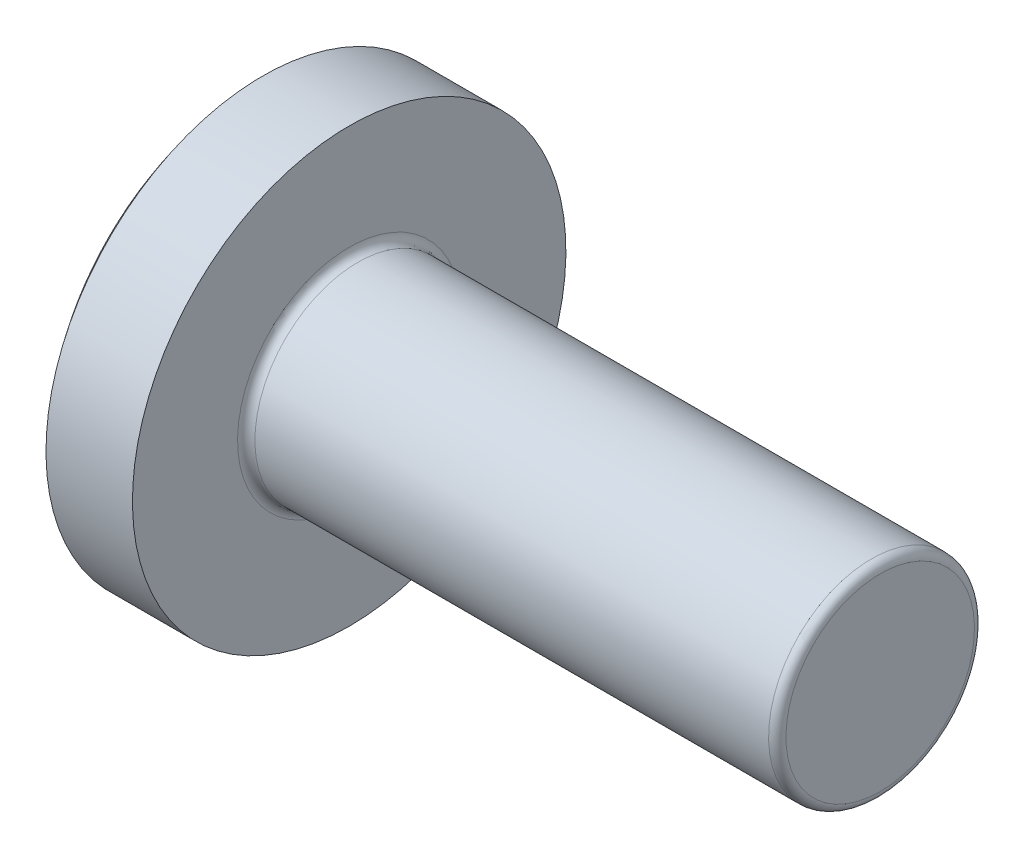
ISO-10303-21;
HEADER;
FILE_DESCRIPTION(('STEP AP214'),'2;1');
FILE_NAME('part.step','',(''),(''),'','','');
FILE_SCHEMA(('AUTOMOTIVE_DESIGN { 1 0 10303 214 1 1 1 1 }'));
ENDSEC;
DATA;
#1=APPLICATION_CONTEXT('core data for automotive mechanical design processes');
#2=APPLICATION_PROTOCOL_DEFINITION('international standard','automotive_design',2000,#1);
#3=PRODUCT_CONTEXT('',#1,'mechanical');
#4=PRODUCT('Part','Part','',(#3));
#5=PRODUCT_RELATED_PRODUCT_CATEGORY('part','',(#4));
#6=PRODUCT_DEFINITION_FORMATION('','',#4);
#7=PRODUCT_DEFINITION_CONTEXT('part definition',#1,'design');
#8=PRODUCT_DEFINITION('design','',#6,#7);
#9=PRODUCT_DEFINITION_SHAPE('','',#8);
#10=(LENGTH_UNIT() NAMED_UNIT(*) SI_UNIT(.MILLI.,.METRE.));
#11=(NAMED_UNIT(*) PLANE_ANGLE_UNIT() SI_UNIT($,.RADIAN.));
#12=(NAMED_UNIT(*) SI_UNIT($,.STERADIAN.) SOLID_ANGLE_UNIT());
#13=UNCERTAINTY_MEASURE_WITH_UNIT(LENGTH_MEASURE(1.E-05),#10,'distance_accuracy_value','');
#14=(GEOMETRIC_REPRESENTATION_CONTEXT(3) GLOBAL_UNCERTAINTY_ASSIGNED_CONTEXT((#13)) GLOBAL_UNIT_ASSIGNED_CONTEXT((#10,
#11,#12)) REPRESENTATION_CONTEXT('',''));
#15=CARTESIAN_POINT('',(0.,0.,0.));
#16=DIRECTION('',(0.,0.,1.));
#17=DIRECTION('',(1.,0.,0.));
#18=AXIS2_PLACEMENT_3D('',#15,#16,#17);
#19=CARTESIAN_POINT('',(16.,0.,0.));
#20=DIRECTION('',(-1.,0.,0.));
#21=DIRECTION('',(0.,1.,0.));
#22=AXIS2_PLACEMENT_3D('',#19,#20,#21);
#23=SPHERICAL_SURFACE('',#22,16.);
#24=CARTESIAN_POINT('',(3.5100040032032,0.,0.));
#25=DIRECTION('',(-1.,0.,0.));
#26=DIRECTION('',(0.,-1.,0.));
#27=AXIS2_PLACEMENT_3D('',#24,#25,#26);
#28=CIRCLE('',#27,10.);
#29=CARTESIAN_POINT('',(3.5100040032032,-10.,0.));
#30=VERTEX_POINT('',#29);
#31=EDGE_CURVE('E190',#30,#30,#28,.T.);
#32=ORIENTED_EDGE('',*,*,#31,.T.);
#33=EDGE_LOOP('',(#32));
#34=FACE_BOUND('',#33,.T.);
#35=CARTESIAN_POINT('',(16.,0.,-1.01));
#36=DIRECTION('',(0.,0.,1.));
#37=DIRECTION('',(0.,-1.,0.));
#38=AXIS2_PLACEMENT_3D('',#35,#36,#37);
#39=CIRCLE('',#38,15.9680900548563);
#40=CARTESIAN_POINT('',(0.71931245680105,4.63470475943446,-1.01));
#41=VERTEX_POINT('',#40);
#42=CARTESIAN_POINT('',(0.0638837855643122,1.01,-1.01));
#43=VERTEX_POINT('',#42);
#44=EDGE_CURVE('E176',#41,#43,#39,.T.);
#45=ORIENTED_EDGE('',*,*,#44,.F.);
#46=CARTESIAN_POINT('',(14.1867141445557,-3.14070323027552,0.));
#47=DIRECTION('',(-0.500000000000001,-0.866025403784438,0.));
#48=DIRECTION('',(0.866025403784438,-0.500000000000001,0.));
#49=AXIS2_PLACEMENT_3D('',#46,#47,#48);
#50=CIRCLE('',#49,15.5835803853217);
#51=CARTESIAN_POINT('',(0.71931245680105,4.63470475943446,1.01));
#52=VERTEX_POINT('',#51);
#53=EDGE_CURVE('E172',#52,#41,#50,.T.);
#54=ORIENTED_EDGE('',*,*,#53,.F.);
#55=CARTESIAN_POINT('',(16.,0.,1.01));
#56=DIRECTION('',(0.,0.,-1.));
#57=DIRECTION('',(0.,1.,0.));
#58=AXIS2_PLACEMENT_3D('',#55,#56,#57);
#59=CIRCLE('',#58,15.9680900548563);
#60=CARTESIAN_POINT('',(0.0638837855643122,1.01,1.01));
#61=VERTEX_POINT('',#60);
#62=EDGE_CURVE('E173',#61,#52,#59,.T.);
#63=ORIENTED_EDGE('',*,*,#62,.F.);
#64=CARTESIAN_POINT('',(16.,1.01,0.));
#65=DIRECTION('',(0.,-1.,0.));
#66=DIRECTION('',(0.,0.,-1.));
#67=AXIS2_PLACEMENT_3D('',#64,#65,#66);
#68=CIRCLE('',#67,15.9680900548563);
#69=CARTESIAN_POINT('',(0.71931245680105,1.01,4.63470475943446));
#70=VERTEX_POINT('',#69);
#71=EDGE_CURVE('E170',#70,#61,#68,.T.);
#72=ORIENTED_EDGE('',*,*,#71,.F.);
#73=CARTESIAN_POINT('',(14.1867141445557,0.,-3.14070323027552));
#74=DIRECTION('',(-0.500000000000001,0.,-0.866025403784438));
#75=DIRECTION('',(-0.866025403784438,0.,0.500000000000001));
#76=AXIS2_PLACEMENT_3D('',#73,#74,#75);
#77=CIRCLE('',#76,15.5835803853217);
#78=CARTESIAN_POINT('',(0.71931245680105,-1.01,4.63470475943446));
#79=VERTEX_POINT('',#78);
#80=EDGE_CURVE('E164',#79,#70,#77,.T.);
#81=ORIENTED_EDGE('',*,*,#80,.F.);
#82=CARTESIAN_POINT('',(16.,-1.01,0.));
#83=DIRECTION('',(0.,1.,0.));
#84=DIRECTION('',(0.,0.,1.));
#85=AXIS2_PLACEMENT_3D('',#82,#83,#84);
#86=CIRCLE('',#85,15.9680900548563);
#87=CARTESIAN_POINT('',(0.0638837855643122,-1.01,1.01));
#88=VERTEX_POINT('',#87);
#89=EDGE_CURVE('E150',#88,#79,#86,.T.);
#90=ORIENTED_EDGE('',*,*,#89,.F.);
#91=CARTESIAN_POINT('',(16.,0.,1.01));
#92=DIRECTION('',(0.,0.,-1.));
#93=DIRECTION('',(0.,1.,0.));
#94=AXIS2_PLACEMENT_3D('',#91,#92,#93);
#95=CIRCLE('',#94,15.9680900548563);
#96=CARTESIAN_POINT('',(0.71931245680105,-4.63470475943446,1.01));
#97=VERTEX_POINT('',#96);
#98=EDGE_CURVE('E139',#97,#88,#95,.T.);
#99=ORIENTED_EDGE('',*,*,#98,.F.);
#100=CARTESIAN_POINT('',(14.1867141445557,3.14070323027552,0.));
#101=DIRECTION('',(-0.500000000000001,0.866025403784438,0.));
#102=DIRECTION('',(-0.866025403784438,-0.500000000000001,0.));
#103=AXIS2_PLACEMENT_3D('',#100,#101,#102);
#104=CIRCLE('',#103,15.5835803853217);
#105=CARTESIAN_POINT('',(0.71931245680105,-4.63470475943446,-1.01));
#106=VERTEX_POINT('',#105);
#107=EDGE_CURVE('E152',#106,#97,#104,.T.);
#108=ORIENTED_EDGE('',*,*,#107,.F.);
#109=CARTESIAN_POINT('',(16.,0.,-1.01));
#110=DIRECTION('',(0.,0.,1.));
#111=DIRECTION('',(0.,-1.,0.));
#112=AXIS2_PLACEMENT_3D('',#109,#110,#111);
#113=CIRCLE('',#112,15.9680900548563);
#114=CARTESIAN_POINT('',(0.0638837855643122,-1.01,-1.01));
#115=VERTEX_POINT('',#114);
#116=EDGE_CURVE('E202',#115,#106,#113,.T.);
#117=ORIENTED_EDGE('',*,*,#116,.F.);
#118=CARTESIAN_POINT('',(16.,-1.01,0.));
#119=DIRECTION('',(0.,1.,0.));
#120=DIRECTION('',(0.,0.,1.));
#121=AXIS2_PLACEMENT_3D('',#118,#119,#120);
#122=CIRCLE('',#121,15.9680900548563);
#123=CARTESIAN_POINT('',(0.71931245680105,-1.01,-4.63470475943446));
#124=VERTEX_POINT('',#123);
#125=EDGE_CURVE('E188',#124,#115,#122,.T.);
#126=ORIENTED_EDGE('',*,*,#125,.F.);
#127=CARTESIAN_POINT('',(14.1867141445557,0.,3.14070323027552));
#128=DIRECTION('',(-0.500000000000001,0.,0.866025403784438));
#129=DIRECTION('',(0.866025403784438,0.,0.500000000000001));
#130=AXIS2_PLACEMENT_3D('',#127,#128,#129);
#131=CIRCLE('',#130,15.5835803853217);
#132=CARTESIAN_POINT('',(0.71931245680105,1.01,-4.63470475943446));
#133=VERTEX_POINT('',#132);
#134=EDGE_CURVE('E189',#133,#124,#131,.T.);
#135=ORIENTED_EDGE('',*,*,#134,.F.);
#136=CARTESIAN_POINT('',(16.,1.01,0.));
#137=DIRECTION('',(0.,-1.,0.));
#138=DIRECTION('',(0.,0.,-1.));
#139=AXIS2_PLACEMENT_3D('',#136,#137,#138);
#140=CIRCLE('',#139,15.9680900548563);
#141=EDGE_CURVE('E191',#43,#133,#140,.T.);
#142=ORIENTED_EDGE('',*,*,#141,.F.);
#143=EDGE_LOOP('',(#45,#54,#63,#72,#81,#90,#99,#108,#117,#126,#135,#142));
#144=FACE_BOUND('',#143,.T.);
#145=ADVANCED_FACE('F43',(#34,#144),#23,.T.);
#146=CARTESIAN_POINT('',(32.,0.,0.));
#147=DIRECTION('',(-1.,0.,0.));
#148=DIRECTION('',(0.,-1.,0.));
#149=AXIS2_PLACEMENT_3D('',#146,#147,#148);
#150=PLANE('',#149);
#151=CARTESIAN_POINT('',(32.,0.,0.));
#152=DIRECTION('',(-1.,0.,0.));
#153=DIRECTION('',(0.,-1.,0.));
#154=AXIS2_PLACEMENT_3D('',#151,#152,#153);
#155=CIRCLE('',#154,4.35000000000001);
#156=CARTESIAN_POINT('',(32.,-4.35000000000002,0.));
#157=VERTEX_POINT('',#156);
#158=EDGE_CURVE('E52',#157,#157,#155,.F.);
#159=ORIENTED_EDGE('',*,*,#158,.T.);
#160=EDGE_LOOP('',(#159));
#161=FACE_BOUND('',#160,.T.);
#162=ADVANCED_FACE('F293',(#161),#150,.F.);
#163=CARTESIAN_POINT('',(-8.63564927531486,0.,0.));
#164=DIRECTION('',(-1.,0.,0.));
#165=DIRECTION('',(0.,-1.,0.));
#166=AXIS2_PLACEMENT_3D('',#163,#164,#165);
#167=CYLINDRICAL_SURFACE('',#166,4.75000000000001);
#168=CARTESIAN_POINT('',(31.6,0.,0.));
#169=DIRECTION('',(-1.,0.,0.));
#170=DIRECTION('',(0.,-1.,0.));
#171=AXIS2_PLACEMENT_3D('',#168,#169,#170);
#172=CIRCLE('',#171,4.75000000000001);
#173=CARTESIAN_POINT('',(31.6,-4.75000000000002,0.));
#174=VERTEX_POINT('',#173);
#175=EDGE_CURVE('E238',#174,#174,#172,.T.);
#176=ORIENTED_EDGE('',*,*,#175,.T.);
#177=EDGE_LOOP('',(#176));
#178=FACE_BOUND('',#177,.T.);
#179=CARTESIAN_POINT('',(7.9,0.,0.));
#180=DIRECTION('',(-1.,0.,0.));
#181=DIRECTION('',(0.,-1.,0.));
#182=AXIS2_PLACEMENT_3D('',#179,#180,#181);
#183=CIRCLE('',#182,4.75000000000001);
#184=CARTESIAN_POINT('',(7.9,-4.75000000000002,0.));
#185=VERTEX_POINT('',#184);
#186=EDGE_CURVE('E232',#185,#185,#183,.F.);
#187=ORIENTED_EDGE('',*,*,#186,.T.);
#188=EDGE_LOOP('',(#187));
#189=FACE_BOUND('',#188,.T.);
#190=ADVANCED_FACE('F299',(#178,#189),#167,.T.);
#191=CARTESIAN_POINT('',(7.5,4.75,0.));
#192=DIRECTION('',(-1.,0.,0.));
#193=DIRECTION('',(0.,-1.,0.));
#194=AXIS2_PLACEMENT_3D('',#191,#192,#193);
#195=PLANE('',#194);
#196=CARTESIAN_POINT('',(7.5,0.,0.));
#197=DIRECTION('',(-1.,0.,0.));
#198=DIRECTION('',(0.,-1.,0.));
#199=AXIS2_PLACEMENT_3D('',#196,#197,#198);
#200=CIRCLE('',#199,5.15000000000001);
#201=CARTESIAN_POINT('',(7.5,-5.15000000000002,0.));
#202=VERTEX_POINT('',#201);
#203=EDGE_CURVE('E11',#202,#202,#200,.T.);
#204=ORIENTED_EDGE('',*,*,#203,.T.);
#205=EDGE_LOOP('',(#204));
#206=FACE_BOUND('',#205,.T.);
#207=CARTESIAN_POINT('',(7.5,0.,0.));
#208=DIRECTION('',(-1.,0.,0.));
#209=DIRECTION('',(0.,-1.,0.));
#210=AXIS2_PLACEMENT_3D('',#207,#208,#209);
#211=CIRCLE('',#210,10.);
#212=CARTESIAN_POINT('',(7.49999999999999,-10.,0.));
#213=VERTEX_POINT('',#212);
#214=EDGE_CURVE('E233',#213,#213,#211,.T.);
#215=ORIENTED_EDGE('',*,*,#214,.F.);
#216=EDGE_LOOP('',(#215));
#217=FACE_BOUND('',#216,.T.);
#218=ADVANCED_FACE('F308',(#206,#217),#195,.F.);
#219=CARTESIAN_POINT('',(-8.63564927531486,0.,0.));
#220=DIRECTION('',(-1.,0.,0.));
#221=DIRECTION('',(0.,-1.,0.));
#222=AXIS2_PLACEMENT_3D('',#219,#220,#221);
#223=CYLINDRICAL_SURFACE('',#222,10.);
#224=ORIENTED_EDGE('',*,*,#31,.F.);
#225=EDGE_LOOP('',(#224));
#226=FACE_BOUND('',#225,.T.);
#227=ORIENTED_EDGE('',*,*,#214,.T.);
#228=EDGE_LOOP('',(#227));
#229=FACE_BOUND('',#228,.T.);
#230=ADVANCED_FACE('F304',(#226,#229),#223,.T.);
#231=CARTESIAN_POINT('',(5.2,5.05,-1.01));
#232=DIRECTION('',(0.,0.,1.));
#233=DIRECTION('',(0.,-1.,0.));
#234=AXIS2_PLACEMENT_3D('',#231,#232,#233);
#235=PLANE('',#234);
#236=ORIENTED_EDGE('',*,*,#44,.T.);
#237=DIRECTION('',(-1.,0.,0.));
#238=VECTOR('',#237,1.);
#239=CARTESIAN_POINT('',(5.2,1.01,-1.01));
#240=LINE('',#239,#238);
#241=CARTESIAN_POINT('',(5.2,1.01,-1.01));
#242=VERTEX_POINT('',#241);
#243=EDGE_CURVE('E62',#242,#43,#240,.T.);
#244=ORIENTED_EDGE('',*,*,#243,.F.);
#245=DIRECTION('',(0.,1.,0.));
#246=VECTOR('',#245,1.);
#247=CARTESIAN_POINT('',(5.2,5.05,-1.01));
#248=LINE('',#247,#246);
#249=CARTESIAN_POINT('',(5.2,2.04777860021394,-1.01));
#250=VERTEX_POINT('',#249);
#251=EDGE_CURVE('E183',#242,#250,#248,.T.);
#252=ORIENTED_EDGE('',*,*,#251,.T.);
#253=DIRECTION('',(-0.866025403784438,0.500000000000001,0.));
#254=VECTOR('',#253,1.);
#255=CARTESIAN_POINT('',(0.,5.05,-1.01));
#256=LINE('',#255,#254);
#257=EDGE_CURVE('E179',#250,#41,#256,.T.);
#258=ORIENTED_EDGE('',*,*,#257,.T.);
#259=EDGE_LOOP('',(#236,#244,#252,#258));
#260=FACE_BOUND('',#259,.T.);
#261=ADVANCED_FACE('F271',(#260),#235,.T.);
#262=CARTESIAN_POINT('',(0.,5.05,0.));
#263=DIRECTION('',(-0.500000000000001,-0.866025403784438,0.));
#264=DIRECTION('',(0.866025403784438,-0.500000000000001,0.));
#265=AXIS2_PLACEMENT_3D('',#262,#263,#264);
#266=PLANE('',#265);
#267=ORIENTED_EDGE('',*,*,#53,.T.);
#268=ORIENTED_EDGE('',*,*,#257,.F.);
#269=DIRECTION('',(0.,0.,1.));
#270=VECTOR('',#269,1.);
#271=CARTESIAN_POINT('',(5.2,2.04777860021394,0.));
#272=LINE('',#271,#270);
#273=CARTESIAN_POINT('',(5.2,2.04777860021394,1.01));
#274=VERTEX_POINT('',#273);
#275=EDGE_CURVE('E185',#250,#274,#272,.T.);
#276=ORIENTED_EDGE('',*,*,#275,.T.);
#277=DIRECTION('',(-0.866025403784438,0.500000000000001,0.));
#278=VECTOR('',#277,1.);
#279=CARTESIAN_POINT('',(3.89999999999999,2.79833395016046,1.01));
#280=LINE('',#279,#278);
#281=EDGE_CURVE('E180',#274,#52,#280,.T.);
#282=ORIENTED_EDGE('',*,*,#281,.T.);
#283=EDGE_LOOP('',(#267,#268,#276,#282));
#284=FACE_BOUND('',#283,.T.);
#285=ADVANCED_FACE('F273',(#284),#266,.T.);
#286=CARTESIAN_POINT('',(5.2,5.05,1.01));
#287=DIRECTION('',(0.,0.,-1.));
#288=DIRECTION('',(0.,1.,0.));
#289=AXIS2_PLACEMENT_3D('',#286,#287,#288);
#290=PLANE('',#289);
#291=ORIENTED_EDGE('',*,*,#62,.T.);
#292=ORIENTED_EDGE('',*,*,#281,.F.);
#293=DIRECTION('',(0.,-1.,0.));
#294=VECTOR('',#293,1.);
#295=CARTESIAN_POINT('',(5.2,5.05,1.01));
#296=LINE('',#295,#294);
#297=CARTESIAN_POINT('',(5.2,1.01,1.01));
#298=VERTEX_POINT('',#297);
#299=EDGE_CURVE('E127',#274,#298,#296,.T.);
#300=ORIENTED_EDGE('',*,*,#299,.T.);
#301=DIRECTION('',(-1.,0.,0.));
#302=VECTOR('',#301,1.);
#303=CARTESIAN_POINT('',(5.2,1.01,1.01));
#304=LINE('',#303,#302);
#305=EDGE_CURVE('E181',#298,#61,#304,.T.);
#306=ORIENTED_EDGE('',*,*,#305,.T.);
#307=EDGE_LOOP('',(#291,#292,#300,#306));
#308=FACE_BOUND('',#307,.T.);
#309=ADVANCED_FACE('F279',(#308),#290,.T.);
#310=CARTESIAN_POINT('',(5.2,1.01,1.01));
#311=DIRECTION('',(0.,-1.,0.));
#312=DIRECTION('',(0.,0.,-1.));
#313=AXIS2_PLACEMENT_3D('',#310,#311,#312);
#314=PLANE('',#313);
#315=ORIENTED_EDGE('',*,*,#71,.T.);
#316=ORIENTED_EDGE('',*,*,#305,.F.);
#317=DIRECTION('',(0.,0.,1.));
#318=VECTOR('',#317,1.);
#319=CARTESIAN_POINT('',(5.2,1.01,1.01));
#320=LINE('',#319,#318);
#321=CARTESIAN_POINT('',(5.2,1.01,2.04777860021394));
#322=VERTEX_POINT('',#321);
#323=EDGE_CURVE('E118',#298,#322,#320,.T.);
#324=ORIENTED_EDGE('',*,*,#323,.T.);
#325=DIRECTION('',(-0.866025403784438,0.,0.500000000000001));
#326=VECTOR('',#325,1.);
#327=CARTESIAN_POINT('',(0.,1.01,5.05));
#328=LINE('',#327,#326);
#329=EDGE_CURVE('E50',#322,#70,#328,.T.);
#330=ORIENTED_EDGE('',*,*,#329,.T.);
#331=EDGE_LOOP('',(#315,#316,#324,#330));
#332=FACE_BOUND('',#331,.T.);
#333=ADVANCED_FACE('F278',(#332),#314,.T.);
#334=CARTESIAN_POINT('',(0.,0.,5.05));
#335=DIRECTION('',(-0.500000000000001,0.,-0.866025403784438));
#336=DIRECTION('',(-0.866025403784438,0.,0.500000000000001));
#337=AXIS2_PLACEMENT_3D('',#334,#335,#336);
#338=PLANE('',#337);
#339=ORIENTED_EDGE('',*,*,#80,.T.);
#340=ORIENTED_EDGE('',*,*,#329,.F.);
#341=DIRECTION('',(0.,-1.,0.));
#342=VECTOR('',#341,1.);
#343=CARTESIAN_POINT('',(5.2,0.,2.04777860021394));
#344=LINE('',#343,#342);
#345=CARTESIAN_POINT('',(5.2,-1.01,2.04777860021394));
#346=VERTEX_POINT('',#345);
#347=EDGE_CURVE('E214',#322,#346,#344,.T.);
#348=ORIENTED_EDGE('',*,*,#347,.T.);
#349=DIRECTION('',(-0.866025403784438,0.,0.500000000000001));
#350=VECTOR('',#349,1.);
#351=CARTESIAN_POINT('',(5.64937131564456,-1.01,1.78833395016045));
#352=LINE('',#351,#350);
#353=EDGE_CURVE('E157',#346,#79,#352,.T.);
#354=ORIENTED_EDGE('',*,*,#353,.T.);
#355=EDGE_LOOP('',(#339,#340,#348,#354));
#356=FACE_BOUND('',#355,.T.);
#357=ADVANCED_FACE('F280',(#356),#338,.T.);
#358=CARTESIAN_POINT('',(5.2,-1.01,1.01));
#359=DIRECTION('',(0.,1.,0.));
#360=DIRECTION('',(0.,0.,1.));
#361=AXIS2_PLACEMENT_3D('',#358,#359,#360);
#362=PLANE('',#361);
#363=ORIENTED_EDGE('',*,*,#89,.T.);
#364=ORIENTED_EDGE('',*,*,#353,.F.);
#365=DIRECTION('',(0.,0.,-1.));
#366=VECTOR('',#365,1.);
#367=CARTESIAN_POINT('',(5.2,-1.01,1.01));
#368=LINE('',#367,#366);
#369=CARTESIAN_POINT('',(5.2,-1.01,1.01));
#370=VERTEX_POINT('',#369);
#371=EDGE_CURVE('E156',#346,#370,#368,.T.);
#372=ORIENTED_EDGE('',*,*,#371,.T.);
#373=DIRECTION('',(-1.,0.,0.));
#374=VECTOR('',#373,1.);
#375=CARTESIAN_POINT('',(5.2,-1.01,1.01));
#376=LINE('',#375,#374);
#377=EDGE_CURVE('E141',#370,#88,#376,.T.);
#378=ORIENTED_EDGE('',*,*,#377,.T.);
#379=EDGE_LOOP('',(#363,#364,#372,#378));
#380=FACE_BOUND('',#379,.T.);
#381=ADVANCED_FACE('F151',(#380),#362,.T.);
#382=CARTESIAN_POINT('',(5.2,-5.05,1.01));
#383=DIRECTION('',(0.,0.,-1.));
#384=DIRECTION('',(0.,1.,0.));
#385=AXIS2_PLACEMENT_3D('',#382,#383,#384);
#386=PLANE('',#385);
#387=ORIENTED_EDGE('',*,*,#98,.T.);
#388=ORIENTED_EDGE('',*,*,#377,.F.);
#389=DIRECTION('',(0.,-1.,0.));
#390=VECTOR('',#389,1.);
#391=CARTESIAN_POINT('',(5.2,-5.05,1.01));
#392=LINE('',#391,#390);
#393=CARTESIAN_POINT('',(5.2,-2.04777860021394,1.01));
#394=VERTEX_POINT('',#393);
#395=EDGE_CURVE('E211',#370,#394,#392,.T.);
#396=ORIENTED_EDGE('',*,*,#395,.T.);
#397=DIRECTION('',(-0.866025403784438,-0.500000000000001,0.));
#398=VECTOR('',#397,1.);
#399=CARTESIAN_POINT('',(0.,-5.05,1.01));
#400=LINE('',#399,#398);
#401=EDGE_CURVE('E146',#394,#97,#400,.T.);
#402=ORIENTED_EDGE('',*,*,#401,.T.);
#403=EDGE_LOOP('',(#387,#388,#396,#402));
#404=FACE_BOUND('',#403,.T.);
#405=ADVANCED_FACE('F145',(#404),#386,.T.);
#406=CARTESIAN_POINT('',(0.,-5.05,0.));
#407=DIRECTION('',(-0.500000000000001,0.866025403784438,0.));
#408=DIRECTION('',(-0.866025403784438,-0.500000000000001,0.));
#409=AXIS2_PLACEMENT_3D('',#406,#407,#408);
#410=PLANE('',#409);
#411=ORIENTED_EDGE('',*,*,#107,.T.);
#412=ORIENTED_EDGE('',*,*,#401,.F.);
#413=DIRECTION('',(0.,0.,-1.));
#414=VECTOR('',#413,1.);
#415=CARTESIAN_POINT('',(5.2,-2.04777860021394,0.));
#416=LINE('',#415,#414);
#417=CARTESIAN_POINT('',(5.2,-2.04777860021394,-1.01));
#418=VERTEX_POINT('',#417);
#419=EDGE_CURVE('E206',#394,#418,#416,.T.);
#420=ORIENTED_EDGE('',*,*,#419,.T.);
#421=DIRECTION('',(-0.866025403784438,-0.500000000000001,0.));
#422=VECTOR('',#421,1.);
#423=CARTESIAN_POINT('',(3.89999999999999,-2.79833395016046,-1.01));
#424=LINE('',#423,#422);
#425=EDGE_CURVE('E204',#418,#106,#424,.T.);
#426=ORIENTED_EDGE('',*,*,#425,.T.);
#427=EDGE_LOOP('',(#411,#412,#420,#426));
#428=FACE_BOUND('',#427,.T.);
#429=ADVANCED_FACE('F251',(#428),#410,.T.);
#430=CARTESIAN_POINT('',(5.2,-5.05,-1.01));
#431=DIRECTION('',(0.,0.,1.));
#432=DIRECTION('',(0.,-1.,0.));
#433=AXIS2_PLACEMENT_3D('',#430,#431,#432);
#434=PLANE('',#433);
#435=ORIENTED_EDGE('',*,*,#116,.T.);
#436=ORIENTED_EDGE('',*,*,#425,.F.);
#437=DIRECTION('',(0.,1.,0.));
#438=VECTOR('',#437,1.);
#439=CARTESIAN_POINT('',(5.2,-5.05,-1.01));
#440=LINE('',#439,#438);
#441=CARTESIAN_POINT('',(5.2,-1.01,-1.01));
#442=VERTEX_POINT('',#441);
#443=EDGE_CURVE('E208',#418,#442,#440,.T.);
#444=ORIENTED_EDGE('',*,*,#443,.T.);
#445=DIRECTION('',(-1.,0.,0.));
#446=VECTOR('',#445,1.);
#447=CARTESIAN_POINT('',(5.2,-1.01,-1.01));
#448=LINE('',#447,#446);
#449=EDGE_CURVE('E205',#442,#115,#448,.T.);
#450=ORIENTED_EDGE('',*,*,#449,.T.);
#451=EDGE_LOOP('',(#435,#436,#444,#450));
#452=FACE_BOUND('',#451,.T.);
#453=ADVANCED_FACE('F248',(#452),#434,.T.);
#454=CARTESIAN_POINT('',(5.2,-1.01,-1.01));
#455=DIRECTION('',(0.,1.,0.));
#456=DIRECTION('',(0.,0.,1.));
#457=AXIS2_PLACEMENT_3D('',#454,#455,#456);
#458=PLANE('',#457);
#459=ORIENTED_EDGE('',*,*,#125,.T.);
#460=ORIENTED_EDGE('',*,*,#449,.F.);
#461=DIRECTION('',(0.,0.,-1.));
#462=VECTOR('',#461,1.);
#463=CARTESIAN_POINT('',(5.2,-1.01,-1.01));
#464=LINE('',#463,#462);
#465=CARTESIAN_POINT('',(5.2,-1.01,-2.04777860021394));
#466=VERTEX_POINT('',#465);
#467=EDGE_CURVE('E196',#442,#466,#464,.T.);
#468=ORIENTED_EDGE('',*,*,#467,.T.);
#469=DIRECTION('',(-0.866025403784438,0.,-0.500000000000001));
#470=VECTOR('',#469,1.);
#471=CARTESIAN_POINT('',(0.,-1.01,-5.05));
#472=LINE('',#471,#470);
#473=EDGE_CURVE('E195',#466,#124,#472,.T.);
#474=ORIENTED_EDGE('',*,*,#473,.T.);
#475=EDGE_LOOP('',(#459,#460,#468,#474));
#476=FACE_BOUND('',#475,.T.);
#477=ADVANCED_FACE('F264',(#476),#458,.T.);
#478=CARTESIAN_POINT('',(0.,0.,-5.05));
#479=DIRECTION('',(-0.500000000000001,0.,0.866025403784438));
#480=DIRECTION('',(0.866025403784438,0.,0.500000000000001));
#481=AXIS2_PLACEMENT_3D('',#478,#479,#480);
#482=PLANE('',#481);
#483=ORIENTED_EDGE('',*,*,#134,.T.);
#484=ORIENTED_EDGE('',*,*,#473,.F.);
#485=DIRECTION('',(0.,1.,0.));
#486=VECTOR('',#485,1.);
#487=CARTESIAN_POINT('',(5.2,0.,-2.04777860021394));
#488=LINE('',#487,#486);
#489=CARTESIAN_POINT('',(5.2,1.01,-2.04777860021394));
#490=VERTEX_POINT('',#489);
#491=EDGE_CURVE('E197',#466,#490,#488,.T.);
#492=ORIENTED_EDGE('',*,*,#491,.T.);
#493=DIRECTION('',(-0.866025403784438,0.,-0.500000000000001));
#494=VECTOR('',#493,1.);
#495=CARTESIAN_POINT('',(5.64937131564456,1.01,-1.78833395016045));
#496=LINE('',#495,#494);
#497=EDGE_CURVE('E192',#490,#133,#496,.T.);
#498=ORIENTED_EDGE('',*,*,#497,.T.);
#499=EDGE_LOOP('',(#483,#484,#492,#498));
#500=FACE_BOUND('',#499,.T.);
#501=ADVANCED_FACE('F44',(#500),#482,.T.);
#502=CARTESIAN_POINT('',(5.2,1.01,-1.01));
#503=DIRECTION('',(0.,-1.,0.));
#504=DIRECTION('',(0.,0.,-1.));
#505=AXIS2_PLACEMENT_3D('',#502,#503,#504);
#506=PLANE('',#505);
#507=ORIENTED_EDGE('',*,*,#141,.T.);
#508=ORIENTED_EDGE('',*,*,#497,.F.);
#509=DIRECTION('',(0.,0.,1.));
#510=VECTOR('',#509,1.);
#511=CARTESIAN_POINT('',(5.2,1.01,-1.01));
#512=LINE('',#511,#510);
#513=EDGE_CURVE('E200',#490,#242,#512,.T.);
#514=ORIENTED_EDGE('',*,*,#513,.T.);
#515=ORIENTED_EDGE('',*,*,#243,.T.);
#516=EDGE_LOOP('',(#507,#508,#514,#515));
#517=FACE_BOUND('',#516,.T.);
#518=ADVANCED_FACE('F267',(#517),#506,.T.);
#519=CARTESIAN_POINT('',(5.2,-1.01,-1.01));
#520=DIRECTION('',(1.,0.,0.));
#521=DIRECTION('',(0.,0.,-1.));
#522=AXIS2_PLACEMENT_3D('',#519,#520,#521);
#523=PLANE('',#522);
#524=ORIENTED_EDGE('',*,*,#251,.F.);
#525=ORIENTED_EDGE('',*,*,#513,.F.);
#526=ORIENTED_EDGE('',*,*,#491,.F.);
#527=ORIENTED_EDGE('',*,*,#467,.F.);
#528=ORIENTED_EDGE('',*,*,#443,.F.);
#529=ORIENTED_EDGE('',*,*,#419,.F.);
#530=ORIENTED_EDGE('',*,*,#395,.F.);
#531=ORIENTED_EDGE('',*,*,#371,.F.);
#532=ORIENTED_EDGE('',*,*,#347,.F.);
#533=ORIENTED_EDGE('',*,*,#323,.F.);
#534=ORIENTED_EDGE('',*,*,#299,.F.);
#535=ORIENTED_EDGE('',*,*,#275,.F.);
#536=EDGE_LOOP('',(#524,#525,#526,#527,#528,#529,#530,#531,#532,#533,#534,#535));
#537=FACE_BOUND('',#536,.T.);
#538=ADVANCED_FACE('F259',(#537),#523,.F.);
#539=CARTESIAN_POINT('',(31.6,0.,0.));
#540=DIRECTION('',(-1.,0.,0.));
#541=DIRECTION('',(0.,-1.,0.));
#542=AXIS2_PLACEMENT_3D('',#539,#540,#541);
#543=TOROIDAL_SURFACE('',#542,4.35000000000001,0.4);
#544=ORIENTED_EDGE('',*,*,#158,.F.);
#545=EDGE_LOOP('',(#544));
#546=FACE_BOUND('',#545,.T.);
#547=ORIENTED_EDGE('',*,*,#175,.F.);
#548=EDGE_LOOP('',(#547));
#549=FACE_BOUND('',#548,.T.);
#550=ADVANCED_FACE('F317',(#546,#549),#543,.T.);
#551=CARTESIAN_POINT('',(7.9,0.,0.));
#552=DIRECTION('',(-1.,0.,0.));
#553=DIRECTION('',(0.,-1.,0.));
#554=AXIS2_PLACEMENT_3D('',#551,#552,#553);
#555=TOROIDAL_SURFACE('',#554,5.15000000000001,0.4);
#556=ORIENTED_EDGE('',*,*,#186,.F.);
#557=EDGE_LOOP('',(#556));
#558=FACE_BOUND('',#557,.T.);
#559=ORIENTED_EDGE('',*,*,#203,.F.);
#560=EDGE_LOOP('',(#559));
#561=FACE_BOUND('',#560,.T.);
#562=ADVANCED_FACE('F316',(#558,#561),#555,.F.);
#563=CLOSED_SHELL('',(#145,#162,#190,#218,#230,#261,#285,#309,#333,#357,#381,#405,#429,#453,
#477,#501,#518,#538,#550,#562));
#564=MANIFOLD_SOLID_BREP('B2',#563);
#565=ADVANCED_BREP_SHAPE_REPRESENTATION('',(#18,#564),#14);
#566=SHAPE_DEFINITION_REPRESENTATION(#9,#565);
ENDSEC;
END-ISO-10303-21;
